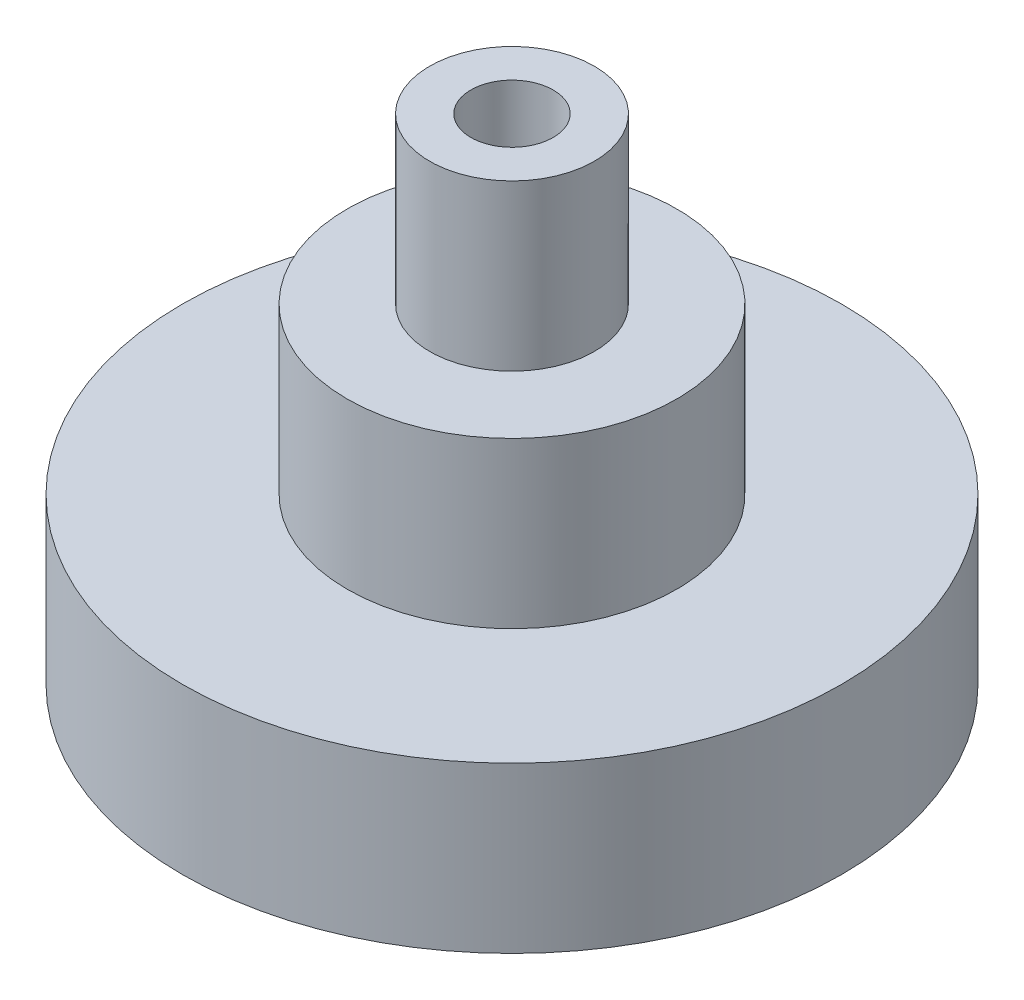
ISO-10303-21;
HEADER;
FILE_DESCRIPTION(('STEP AP214'),'2;1');
FILE_NAME('part.step','',(''),(''),'','','');
FILE_SCHEMA(('AUTOMOTIVE_DESIGN { 1 0 10303 214 1 1 1 1 }'));
ENDSEC;
DATA;
#1=APPLICATION_CONTEXT('core data for automotive mechanical design processes');
#2=APPLICATION_PROTOCOL_DEFINITION('international standard','automotive_design',2000,#1);
#3=PRODUCT_CONTEXT('',#1,'mechanical');
#4=PRODUCT('Part','Part','',(#3));
#5=PRODUCT_RELATED_PRODUCT_CATEGORY('part','',(#4));
#6=PRODUCT_DEFINITION_FORMATION('','',#4);
#7=PRODUCT_DEFINITION_CONTEXT('part definition',#1,'design');
#8=PRODUCT_DEFINITION('design','',#6,#7);
#9=PRODUCT_DEFINITION_SHAPE('','',#8);
#10=(LENGTH_UNIT() NAMED_UNIT(*) SI_UNIT(.MILLI.,.METRE.));
#11=(NAMED_UNIT(*) PLANE_ANGLE_UNIT() SI_UNIT($,.RADIAN.));
#12=(NAMED_UNIT(*) SI_UNIT($,.STERADIAN.) SOLID_ANGLE_UNIT());
#13=UNCERTAINTY_MEASURE_WITH_UNIT(LENGTH_MEASURE(1.E-05),#10,'distance_accuracy_value','');
#14=(GEOMETRIC_REPRESENTATION_CONTEXT(3) GLOBAL_UNCERTAINTY_ASSIGNED_CONTEXT((#13)) GLOBAL_UNIT_ASSIGNED_CONTEXT((#10,
#11,#12)) REPRESENTATION_CONTEXT('',''));
#15=CARTESIAN_POINT('',(0.,0.,0.));
#16=DIRECTION('',(0.,0.,1.));
#17=DIRECTION('',(1.,0.,0.));
#18=AXIS2_PLACEMENT_3D('',#15,#16,#17);
#19=CARTESIAN_POINT('',(-40.0045087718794,38.1,-10.2943198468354));
#20=DIRECTION('',(0.,-1.,0.));
#21=DIRECTION('',(0.,0.,-1.));
#22=AXIS2_PLACEMENT_3D('',#19,#20,#21);
#23=CYLINDRICAL_SURFACE('',#22,3.175);
#24=CARTESIAN_POINT('',(-40.0045087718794,38.1,-10.2943198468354));
#25=DIRECTION('',(0.,1.,0.));
#26=DIRECTION('',(0.,0.,1.));
#27=AXIS2_PLACEMENT_3D('',#24,#25,#26);
#28=CIRCLE('',#27,3.175);
#29=CARTESIAN_POINT('',(-40.0045087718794,38.1,-13.4693198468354));
#30=VERTEX_POINT('',#29);
#31=EDGE_CURVE('E38',#30,#30,#28,.T.);
#32=CARTESIAN_POINT('',(-40.0045087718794,0.,-10.2943198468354));
#33=DIRECTION('',(0.,1.,0.));
#34=DIRECTION('',(0.,0.,1.));
#35=AXIS2_PLACEMENT_3D('',#32,#33,#34);
#36=CIRCLE('',#35,3.175);
#37=CARTESIAN_POINT('',(-40.0045087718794,0.,-13.4693198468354));
#38=VERTEX_POINT('',#37);
#39=EDGE_CURVE('E34',#38,#38,#36,.T.);
#40=CARTESIAN_POINT('',(-40.0045087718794,38.1,-13.4693198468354));
#41=CARTESIAN_POINT('',(-40.0045087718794,37.703125,-13.4693198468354));
#42=CARTESIAN_POINT('',(-40.0045087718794,37.30625,-13.4693198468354));
#43=CARTESIAN_POINT('',(-40.0045087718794,36.5125,-13.4693198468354));
#44=CARTESIAN_POINT('',(-40.0045087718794,36.115625,-13.4693198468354));
#45=CARTESIAN_POINT('',(-40.0045087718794,35.321875,-13.4693198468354));
#46=CARTESIAN_POINT('',(-40.0045087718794,34.925,-13.4693198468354));
#47=CARTESIAN_POINT('',(-40.0045087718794,34.13125,-13.4693198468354));
#48=CARTESIAN_POINT('',(-40.0045087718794,33.734375,-13.4693198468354));
#49=CARTESIAN_POINT('',(-40.0045087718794,32.940625,-13.4693198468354));
#50=CARTESIAN_POINT('',(-40.0045087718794,32.54375,-13.4693198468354));
#51=CARTESIAN_POINT('',(-40.0045087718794,31.75,-13.4693198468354));
#52=CARTESIAN_POINT('',(-40.0045087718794,31.353125,-13.4693198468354));
#53=CARTESIAN_POINT('',(-40.0045087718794,30.559375,-13.4693198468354));
#54=CARTESIAN_POINT('',(-40.0045087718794,30.1625,-13.4693198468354));
#55=CARTESIAN_POINT('',(-40.0045087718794,29.36875,-13.4693198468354));
#56=CARTESIAN_POINT('',(-40.0045087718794,28.971875,-13.4693198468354));
#57=CARTESIAN_POINT('',(-40.0045087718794,28.178125,-13.4693198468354));
#58=CARTESIAN_POINT('',(-40.0045087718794,27.78125,-13.4693198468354));
#59=CARTESIAN_POINT('',(-40.0045087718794,26.9875,-13.4693198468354));
#60=CARTESIAN_POINT('',(-40.0045087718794,26.590625,-13.4693198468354));
#61=CARTESIAN_POINT('',(-40.0045087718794,25.796875,-13.4693198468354));
#62=CARTESIAN_POINT('',(-40.0045087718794,25.4,-13.4693198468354));
#63=CARTESIAN_POINT('',(-40.0045087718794,24.60625,-13.4693198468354));
#64=CARTESIAN_POINT('',(-40.0045087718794,24.209375,-13.4693198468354));
#65=CARTESIAN_POINT('',(-40.0045087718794,23.415625,-13.4693198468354));
#66=CARTESIAN_POINT('',(-40.0045087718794,23.01875,-13.4693198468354));
#67=CARTESIAN_POINT('',(-40.0045087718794,22.225,-13.4693198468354));
#68=CARTESIAN_POINT('',(-40.0045087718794,21.828125,-13.4693198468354));
#69=CARTESIAN_POINT('',(-40.0045087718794,21.034375,-13.4693198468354));
#70=CARTESIAN_POINT('',(-40.0045087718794,20.6375,-13.4693198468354));
#71=CARTESIAN_POINT('',(-40.0045087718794,19.84375,-13.4693198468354));
#72=CARTESIAN_POINT('',(-40.0045087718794,19.446875,-13.4693198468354));
#73=CARTESIAN_POINT('',(-40.0045087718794,18.653125,-13.4693198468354));
#74=CARTESIAN_POINT('',(-40.0045087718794,18.25625,-13.4693198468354));
#75=CARTESIAN_POINT('',(-40.0045087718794,17.4625,-13.4693198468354));
#76=CARTESIAN_POINT('',(-40.0045087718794,17.065625,-13.4693198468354));
#77=CARTESIAN_POINT('',(-40.0045087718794,16.271875,-13.4693198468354));
#78=CARTESIAN_POINT('',(-40.0045087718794,15.875,-13.4693198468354));
#79=CARTESIAN_POINT('',(-40.0045087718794,15.08125,-13.4693198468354));
#80=CARTESIAN_POINT('',(-40.0045087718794,14.684375,-13.4693198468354));
#81=CARTESIAN_POINT('',(-40.0045087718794,13.890625,-13.4693198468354));
#82=CARTESIAN_POINT('',(-40.0045087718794,13.49375,-13.4693198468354));
#83=CARTESIAN_POINT('',(-40.0045087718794,12.7,-13.4693198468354));
#84=CARTESIAN_POINT('',(-40.0045087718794,12.303125,-13.4693198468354));
#85=CARTESIAN_POINT('',(-40.0045087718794,11.509375,-13.4693198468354));
#86=CARTESIAN_POINT('',(-40.0045087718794,11.1125,-13.4693198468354));
#87=CARTESIAN_POINT('',(-40.0045087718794,10.31875,-13.4693198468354));
#88=CARTESIAN_POINT('',(-40.0045087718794,9.921875,-13.4693198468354));
#89=CARTESIAN_POINT('',(-40.0045087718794,9.128125,-13.4693198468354));
#90=CARTESIAN_POINT('',(-40.0045087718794,8.73125,-13.4693198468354));
#91=CARTESIAN_POINT('',(-40.0045087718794,7.9375,-13.4693198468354));
#92=CARTESIAN_POINT('',(-40.0045087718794,7.540625,-13.4693198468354));
#93=CARTESIAN_POINT('',(-40.0045087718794,6.746875,-13.4693198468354));
#94=CARTESIAN_POINT('',(-40.0045087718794,6.35,-13.4693198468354));
#95=CARTESIAN_POINT('',(-40.0045087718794,5.55625,-13.4693198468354));
#96=CARTESIAN_POINT('',(-40.0045087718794,5.159375,-13.4693198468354));
#97=CARTESIAN_POINT('',(-40.0045087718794,4.365625,-13.4693198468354));
#98=CARTESIAN_POINT('',(-40.0045087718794,3.96875,-13.4693198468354));
#99=CARTESIAN_POINT('',(-40.0045087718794,3.175,-13.4693198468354));
#100=CARTESIAN_POINT('',(-40.0045087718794,2.778125,-13.4693198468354));
#101=CARTESIAN_POINT('',(-40.0045087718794,1.984375,-13.4693198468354));
#102=CARTESIAN_POINT('',(-40.0045087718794,1.5875,-13.4693198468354));
#103=CARTESIAN_POINT('',(-40.0045087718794,0.79375,-13.4693198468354));
#104=CARTESIAN_POINT('',(-40.0045087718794,0.396875,-13.4693198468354));
#105=CARTESIAN_POINT('',(-40.0045087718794,0.,-13.4693198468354));
#106=B_SPLINE_CURVE_WITH_KNOTS('',3,(#40,#41,#42,#43,#44,#45,#46,#47,#48,#49,#50,#51,#52,#53,
#54,#55,#56,#57,#58,#59,#60,#61,#62,#63,#64,#65,#66,#67,#68,#69,#70,#71,#72,#73,#74,#75,#76,#77,
#78,#79,#80,#81,#82,#83,#84,#85,#86,#87,#88,#89,#90,#91,#92,#93,#94,#95,#96,#97,#98,#99,#100,
#101,#102,#103,#104,#105),.UNSPECIFIED.,.F.,.F.,(4,2,2,2,2,2,2,2,2,2,2,2,2,2,2,2,2,2,2,2,2,2,2,
2,2,2,2,2,2,2,2,2,4),(0.,1.19062499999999,2.38124999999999,3.571875,4.7625,5.953125,7.14375,
8.33437499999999,9.525,10.715625,11.90625,13.096875,14.2875,15.478125,16.66875,17.859375,19.05,
20.240625,21.43125,22.621875,23.8125,25.003125,26.19375,27.384375,28.575,29.765625,30.95625,
32.146875,33.3375,34.528125,35.71875,36.909375,38.1),.UNSPECIFIED.);
#107=EDGE_CURVE('BSEAM31',#30,#38,#106,.T.);
#108=ORIENTED_EDGE('',*,*,#31,.T.);
#109=ORIENTED_EDGE('',*,*,#39,.F.);
#110=ORIENTED_EDGE('',*,*,#107,.T.);
#111=ORIENTED_EDGE('',*,*,#107,.F.);
#112=EDGE_LOOP('',(#108,#110,#109,#111));
#113=FACE_BOUND('',#112,.T.);
#114=ADVANCED_FACE('F31',(#113),#23,.F.);
#115=CARTESIAN_POINT('',(-40.0045087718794,38.1,-10.2943198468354));
#116=DIRECTION('',(0.,-1.,0.));
#117=DIRECTION('',(0.,0.,-1.));
#118=AXIS2_PLACEMENT_3D('',#115,#116,#117);
#119=CYLINDRICAL_SURFACE('',#118,6.35);
#120=CARTESIAN_POINT('',(-40.0045087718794,25.4,-10.2943198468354));
#121=DIRECTION('',(0.,1.,0.));
#122=DIRECTION('',(0.,0.,1.));
#123=AXIS2_PLACEMENT_3D('',#120,#121,#122);
#124=CIRCLE('',#123,6.35);
#125=CARTESIAN_POINT('',(-40.0045087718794,25.4,-16.6443198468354));
#126=VERTEX_POINT('',#125);
#127=EDGE_CURVE('E47',#126,#126,#124,.T.);
#128=CARTESIAN_POINT('',(-40.0045087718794,38.1,-10.2943198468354));
#129=DIRECTION('',(0.,1.,0.));
#130=DIRECTION('',(0.,0.,1.));
#131=AXIS2_PLACEMENT_3D('',#128,#129,#130);
#132=CIRCLE('',#131,6.35);
#133=CARTESIAN_POINT('',(-40.0045087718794,38.1,-16.6443198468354));
#134=VERTEX_POINT('',#133);
#135=EDGE_CURVE('E10',#134,#134,#132,.T.);
#136=CARTESIAN_POINT('',(-40.0045087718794,25.4,-16.6443198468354));
#137=CARTESIAN_POINT('',(-40.0045087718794,25.5322916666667,-16.6443198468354));
#138=CARTESIAN_POINT('',(-40.0045087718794,25.6645833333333,-16.6443198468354));
#139=CARTESIAN_POINT('',(-40.0045087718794,25.9291666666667,-16.6443198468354));
#140=CARTESIAN_POINT('',(-40.0045087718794,26.0614583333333,-16.6443198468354));
#141=CARTESIAN_POINT('',(-40.0045087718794,26.3260416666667,-16.6443198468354));
#142=CARTESIAN_POINT('',(-40.0045087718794,26.4583333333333,-16.6443198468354));
#143=CARTESIAN_POINT('',(-40.0045087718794,26.7229166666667,-16.6443198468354));
#144=CARTESIAN_POINT('',(-40.0045087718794,26.8552083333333,-16.6443198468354));
#145=CARTESIAN_POINT('',(-40.0045087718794,27.1197916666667,-16.6443198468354));
#146=CARTESIAN_POINT('',(-40.0045087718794,27.2520833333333,-16.6443198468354));
#147=CARTESIAN_POINT('',(-40.0045087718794,27.5166666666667,-16.6443198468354));
#148=CARTESIAN_POINT('',(-40.0045087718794,27.6489583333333,-16.6443198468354));
#149=CARTESIAN_POINT('',(-40.0045087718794,27.9135416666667,-16.6443198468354));
#150=CARTESIAN_POINT('',(-40.0045087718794,28.0458333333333,-16.6443198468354));
#151=CARTESIAN_POINT('',(-40.0045087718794,28.3104166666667,-16.6443198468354));
#152=CARTESIAN_POINT('',(-40.0045087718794,28.4427083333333,-16.6443198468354));
#153=CARTESIAN_POINT('',(-40.0045087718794,28.7072916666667,-16.6443198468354));
#154=CARTESIAN_POINT('',(-40.0045087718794,28.8395833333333,-16.6443198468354));
#155=CARTESIAN_POINT('',(-40.0045087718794,29.1041666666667,-16.6443198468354));
#156=CARTESIAN_POINT('',(-40.0045087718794,29.2364583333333,-16.6443198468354));
#157=CARTESIAN_POINT('',(-40.0045087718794,29.5010416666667,-16.6443198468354));
#158=CARTESIAN_POINT('',(-40.0045087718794,29.6333333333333,-16.6443198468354));
#159=CARTESIAN_POINT('',(-40.0045087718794,29.8979166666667,-16.6443198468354));
#160=CARTESIAN_POINT('',(-40.0045087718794,30.0302083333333,-16.6443198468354));
#161=CARTESIAN_POINT('',(-40.0045087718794,30.2947916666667,-16.6443198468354));
#162=CARTESIAN_POINT('',(-40.0045087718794,30.4270833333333,-16.6443198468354));
#163=CARTESIAN_POINT('',(-40.0045087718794,30.6916666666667,-16.6443198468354));
#164=CARTESIAN_POINT('',(-40.0045087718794,30.8239583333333,-16.6443198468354));
#165=CARTESIAN_POINT('',(-40.0045087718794,31.0885416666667,-16.6443198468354));
#166=CARTESIAN_POINT('',(-40.0045087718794,31.2208333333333,-16.6443198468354));
#167=CARTESIAN_POINT('',(-40.0045087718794,31.4854166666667,-16.6443198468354));
#168=CARTESIAN_POINT('',(-40.0045087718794,31.6177083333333,-16.6443198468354));
#169=CARTESIAN_POINT('',(-40.0045087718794,31.8822916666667,-16.6443198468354));
#170=CARTESIAN_POINT('',(-40.0045087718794,32.0145833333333,-16.6443198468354));
#171=CARTESIAN_POINT('',(-40.0045087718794,32.2791666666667,-16.6443198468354));
#172=CARTESIAN_POINT('',(-40.0045087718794,32.4114583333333,-16.6443198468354));
#173=CARTESIAN_POINT('',(-40.0045087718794,32.6760416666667,-16.6443198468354));
#174=CARTESIAN_POINT('',(-40.0045087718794,32.8083333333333,-16.6443198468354));
#175=CARTESIAN_POINT('',(-40.0045087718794,33.0729166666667,-16.6443198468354));
#176=CARTESIAN_POINT('',(-40.0045087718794,33.2052083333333,-16.6443198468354));
#177=CARTESIAN_POINT('',(-40.0045087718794,33.4697916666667,-16.6443198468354));
#178=CARTESIAN_POINT('',(-40.0045087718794,33.6020833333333,-16.6443198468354));
#179=CARTESIAN_POINT('',(-40.0045087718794,33.8666666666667,-16.6443198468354));
#180=CARTESIAN_POINT('',(-40.0045087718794,33.9989583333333,-16.6443198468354));
#181=CARTESIAN_POINT('',(-40.0045087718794,34.2635416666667,-16.6443198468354));
#182=CARTESIAN_POINT('',(-40.0045087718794,34.3958333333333,-16.6443198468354));
#183=CARTESIAN_POINT('',(-40.0045087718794,34.6604166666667,-16.6443198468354));
#184=CARTESIAN_POINT('',(-40.0045087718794,34.7927083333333,-16.6443198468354));
#185=CARTESIAN_POINT('',(-40.0045087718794,35.0572916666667,-16.6443198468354));
#186=CARTESIAN_POINT('',(-40.0045087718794,35.1895833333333,-16.6443198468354));
#187=CARTESIAN_POINT('',(-40.0045087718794,35.4541666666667,-16.6443198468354));
#188=CARTESIAN_POINT('',(-40.0045087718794,35.5864583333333,-16.6443198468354));
#189=CARTESIAN_POINT('',(-40.0045087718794,35.8510416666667,-16.6443198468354));
#190=CARTESIAN_POINT('',(-40.0045087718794,35.9833333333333,-16.6443198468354));
#191=CARTESIAN_POINT('',(-40.0045087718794,36.2479166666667,-16.6443198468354));
#192=CARTESIAN_POINT('',(-40.0045087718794,36.3802083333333,-16.6443198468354));
#193=CARTESIAN_POINT('',(-40.0045087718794,36.6447916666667,-16.6443198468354));
#194=CARTESIAN_POINT('',(-40.0045087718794,36.7770833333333,-16.6443198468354));
#195=CARTESIAN_POINT('',(-40.0045087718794,37.0416666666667,-16.6443198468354));
#196=CARTESIAN_POINT('',(-40.0045087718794,37.1739583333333,-16.6443198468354));
#197=CARTESIAN_POINT('',(-40.0045087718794,37.4385416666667,-16.6443198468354));
#198=CARTESIAN_POINT('',(-40.0045087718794,37.5708333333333,-16.6443198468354));
#199=CARTESIAN_POINT('',(-40.0045087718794,37.8354166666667,-16.6443198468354));
#200=CARTESIAN_POINT('',(-40.0045087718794,37.9677083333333,-16.6443198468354));
#201=CARTESIAN_POINT('',(-40.0045087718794,38.1,-16.6443198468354));
#202=B_SPLINE_CURVE_WITH_KNOTS('',3,(#136,#137,#138,#139,#140,#141,#142,#143,#144,#145,#146,
#147,#148,#149,#150,#151,#152,#153,#154,#155,#156,#157,#158,#159,#160,#161,#162,#163,#164,#165,
#166,#167,#168,#169,#170,#171,#172,#173,#174,#175,#176,#177,#178,#179,#180,#181,#182,#183,#184,
#185,#186,#187,#188,#189,#190,#191,#192,#193,#194,#195,#196,#197,#198,#199,#200,#201),
.UNSPECIFIED.,.F.,.F.,(4,2,2,2,2,2,2,2,2,2,2,2,2,2,2,2,2,2,2,2,2,2,2,2,2,2,2,2,2,2,2,2,4),(0.,
0.396874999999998,0.793749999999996,1.190625,1.5875,1.984375,2.38125,2.778125,3.175,3.571875,
3.96875,4.365625,4.7625,5.159375,5.55625,5.953125,6.35,6.746875,7.14375,7.540625,7.9375,
8.334375,8.73125,9.128125,9.525,9.921875,10.31875,10.715625,11.1125,11.509375,11.90625,
12.303125,12.7),.UNSPECIFIED.);
#203=EDGE_CURVE('BSEAM86',#126,#134,#202,.T.);
#204=ORIENTED_EDGE('',*,*,#127,.T.);
#205=ORIENTED_EDGE('',*,*,#135,.F.);
#206=ORIENTED_EDGE('',*,*,#203,.T.);
#207=ORIENTED_EDGE('',*,*,#203,.F.);
#208=EDGE_LOOP('',(#204,#206,#205,#207));
#209=FACE_BOUND('',#208,.T.);
#210=ADVANCED_FACE('F86',(#209),#119,.T.);
#211=CARTESIAN_POINT('',(-96.0259301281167,38.1,-10.2943198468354));
#212=DIRECTION('',(0.,1.,0.));
#213=DIRECTION('',(0.,0.,1.));
#214=AXIS2_PLACEMENT_3D('',#211,#212,#213);
#215=PLANE('',#214);
#216=ORIENTED_EDGE('',*,*,#31,.F.);
#217=EDGE_LOOP('',(#216));
#218=FACE_BOUND('',#217,.T.);
#219=ORIENTED_EDGE('',*,*,#135,.T.);
#220=EDGE_LOOP('',(#219));
#221=FACE_BOUND('',#220,.T.);
#222=ADVANCED_FACE('F78',(#218,#221),#215,.T.);
#223=CARTESIAN_POINT('',(-96.0259301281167,0.,-10.2943198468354));
#224=DIRECTION('',(0.,1.,0.));
#225=DIRECTION('',(0.,0.,1.));
#226=AXIS2_PLACEMENT_3D('',#223,#224,#225);
#227=PLANE('',#226);
#228=ORIENTED_EDGE('',*,*,#39,.T.);
#229=EDGE_LOOP('',(#228));
#230=FACE_BOUND('',#229,.T.);
#231=CARTESIAN_POINT('',(-40.0045087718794,0.,-10.2943198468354));
#232=DIRECTION('',(0.,1.,0.));
#233=DIRECTION('',(0.,0.,1.));
#234=AXIS2_PLACEMENT_3D('',#231,#232,#233);
#235=CIRCLE('',#234,25.4);
#236=CARTESIAN_POINT('',(-40.0045087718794,0.,15.1056801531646));
#237=VERTEX_POINT('',#236);
#238=EDGE_CURVE('E51',#237,#237,#235,.T.);
#239=ORIENTED_EDGE('',*,*,#238,.F.);
#240=EDGE_LOOP('',(#239));
#241=FACE_BOUND('',#240,.T.);
#242=ADVANCED_FACE('F76',(#230,#241),#227,.F.);
#243=CARTESIAN_POINT('',(-40.0045087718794,25.4,-10.2943198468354));
#244=DIRECTION('',(0.,-1.,0.));
#245=DIRECTION('',(0.,0.,-1.));
#246=AXIS2_PLACEMENT_3D('',#243,#244,#245);
#247=CYLINDRICAL_SURFACE('',#246,12.7);
#248=CARTESIAN_POINT('',(-40.0045087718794,12.7,-10.2943198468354));
#249=DIRECTION('',(0.,1.,0.));
#250=DIRECTION('',(0.,0.,1.));
#251=AXIS2_PLACEMENT_3D('',#248,#249,#250);
#252=CIRCLE('',#251,12.7);
#253=CARTESIAN_POINT('',(-40.0045087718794,12.7,2.4056801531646));
#254=VERTEX_POINT('',#253);
#255=EDGE_CURVE('E54',#254,#254,#252,.T.);
#256=ORIENTED_EDGE('',*,*,#255,.T.);
#257=EDGE_LOOP('',(#256));
#258=FACE_BOUND('',#257,.T.);
#259=CARTESIAN_POINT('',(-40.0045087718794,25.4,-10.2943198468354));
#260=DIRECTION('',(0.,1.,0.));
#261=DIRECTION('',(0.,0.,1.));
#262=AXIS2_PLACEMENT_3D('',#259,#260,#261);
#263=CIRCLE('',#262,12.7);
#264=CARTESIAN_POINT('',(-40.0045087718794,25.4,2.4056801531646));
#265=VERTEX_POINT('',#264);
#266=EDGE_CURVE('E44',#265,#265,#263,.T.);
#267=ORIENTED_EDGE('',*,*,#266,.F.);
#268=EDGE_LOOP('',(#267));
#269=FACE_BOUND('',#268,.T.);
#270=ADVANCED_FACE('F60',(#258,#269),#247,.T.);
#271=CARTESIAN_POINT('',(-96.0259301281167,25.4,-10.2943198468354));
#272=DIRECTION('',(0.,1.,0.));
#273=DIRECTION('',(0.,0.,1.));
#274=AXIS2_PLACEMENT_3D('',#271,#272,#273);
#275=PLANE('',#274);
#276=ORIENTED_EDGE('',*,*,#127,.F.);
#277=EDGE_LOOP('',(#276));
#278=FACE_BOUND('',#277,.T.);
#279=ORIENTED_EDGE('',*,*,#266,.T.);
#280=EDGE_LOOP('',(#279));
#281=FACE_BOUND('',#280,.T.);
#282=ADVANCED_FACE('F72',(#278,#281),#275,.T.);
#283=CARTESIAN_POINT('',(-40.0045087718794,12.7,-10.2943198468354));
#284=DIRECTION('',(0.,-1.,0.));
#285=DIRECTION('',(0.,0.,-1.));
#286=AXIS2_PLACEMENT_3D('',#283,#284,#285);
#287=CYLINDRICAL_SURFACE('',#286,25.4);
#288=CARTESIAN_POINT('',(-40.0045087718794,12.7,-10.2943198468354));
#289=DIRECTION('',(0.,1.,0.));
#290=DIRECTION('',(0.,0.,1.));
#291=AXIS2_PLACEMENT_3D('',#288,#289,#290);
#292=CIRCLE('',#291,25.4);
#293=CARTESIAN_POINT('',(-40.0045087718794,12.7,15.1056801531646));
#294=VERTEX_POINT('',#293);
#295=EDGE_CURVE('E50',#294,#294,#292,.T.);
#296=ORIENTED_EDGE('',*,*,#295,.F.);
#297=EDGE_LOOP('',(#296));
#298=FACE_BOUND('',#297,.T.);
#299=ORIENTED_EDGE('',*,*,#238,.T.);
#300=EDGE_LOOP('',(#299));
#301=FACE_BOUND('',#300,.T.);
#302=ADVANCED_FACE('F66',(#298,#301),#287,.T.);
#303=CARTESIAN_POINT('',(-96.0259301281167,12.7,-10.2943198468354));
#304=DIRECTION('',(0.,1.,0.));
#305=DIRECTION('',(0.,0.,1.));
#306=AXIS2_PLACEMENT_3D('',#303,#304,#305);
#307=PLANE('',#306);
#308=ORIENTED_EDGE('',*,*,#255,.F.);
#309=EDGE_LOOP('',(#308));
#310=FACE_BOUND('',#309,.T.);
#311=ORIENTED_EDGE('',*,*,#295,.T.);
#312=EDGE_LOOP('',(#311));
#313=FACE_BOUND('',#312,.T.);
#314=ADVANCED_FACE('F63',(#310,#313),#307,.T.);
#315=CLOSED_SHELL('',(#114,#210,#222,#242,#270,#282,#302,#314));
#316=MANIFOLD_SOLID_BREP('B2',#315);
#317=ADVANCED_BREP_SHAPE_REPRESENTATION('',(#18,#316),#14);
#318=SHAPE_DEFINITION_REPRESENTATION(#9,#317);
ENDSEC;
END-ISO-10303-21;
